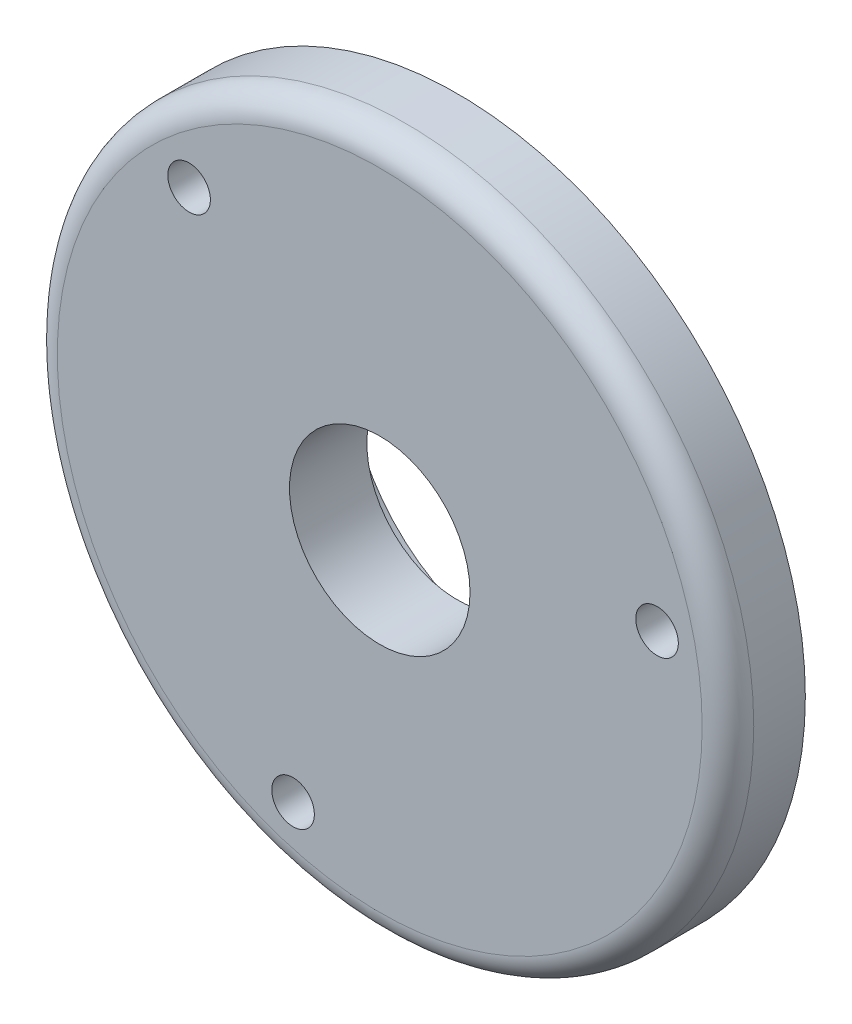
from build123d import *

# Parameters (mm, degrees)
SKETCH_2_R         = 17.5
SKETCH_2_R_2       = 13.204
EXTRUDE_1_DEPTH    = 4.75
SKETCH_3_R         = 27
SKETCH_3_R_2       = 7
EXTRUDE_2_DEPTH    = 6
HOLE_WIZARD_M4_1_D = 3.3
FILLET_1_R         = 2


with BuildPart() as part:
    # Sketch 2 → Extrude 1 (new body)
    with BuildSketch(Plane.XY.offset(1.25)):
        Circle(SKETCH_2_R)
        Circle(SKETCH_2_R_2, mode=Mode.SUBTRACT)
    extrude(amount=EXTRUDE_1_DEPTH)

    # Sketch 3 → Extrude 2 (add)
    with BuildSketch(Plane.XY.offset(6)):
        Circle(SKETCH_3_R)
        Circle(SKETCH_3_R_2, mode=Mode.SUBTRACT)
    extrude(amount=EXTRUDE_2_DEPTH)

    # Hole Wizard M4 _1 (through all)
    with Locations(Plane.XY.offset(12)):
        with Locations((-6.720183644, -20.948487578), (-14.781830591, 16.294093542), (21.502014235, 4.654394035)):
            Hole(HOLE_WIZARD_M4_1_D / 2)

    # Fillet 1
    fillet_1_edges = [part.edges().sort_by_distance(p)[0] for p in [
        (-27, 0, 12),
    ]]
    fillet(fillet_1_edges, radius=FILLET_1_R)


solid = part.part
